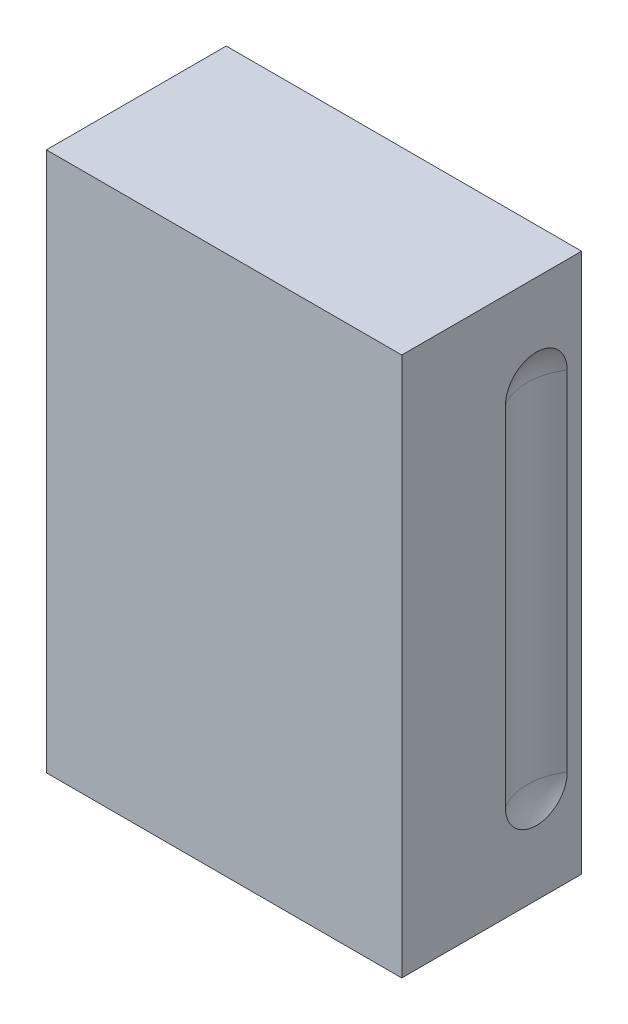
ISO-10303-21;
HEADER;
FILE_DESCRIPTION(('STEP AP214'),'2;1');
FILE_NAME('part.step','',(''),(''),'','','');
FILE_SCHEMA(('AUTOMOTIVE_DESIGN { 1 0 10303 214 1 1 1 1 }'));
ENDSEC;
DATA;
#1=APPLICATION_CONTEXT('core data for automotive mechanical design processes');
#2=APPLICATION_PROTOCOL_DEFINITION('international standard','automotive_design',2000,#1);
#3=PRODUCT_CONTEXT('',#1,'mechanical');
#4=PRODUCT('Part','Part','',(#3));
#5=PRODUCT_RELATED_PRODUCT_CATEGORY('part','',(#4));
#6=PRODUCT_DEFINITION_FORMATION('','',#4);
#7=PRODUCT_DEFINITION_CONTEXT('part definition',#1,'design');
#8=PRODUCT_DEFINITION('design','',#6,#7);
#9=PRODUCT_DEFINITION_SHAPE('','',#8);
#10=(LENGTH_UNIT() NAMED_UNIT(*) SI_UNIT(.MILLI.,.METRE.));
#11=(NAMED_UNIT(*) PLANE_ANGLE_UNIT() SI_UNIT($,.RADIAN.));
#12=(NAMED_UNIT(*) SI_UNIT($,.STERADIAN.) SOLID_ANGLE_UNIT());
#13=UNCERTAINTY_MEASURE_WITH_UNIT(LENGTH_MEASURE(1.E-05),#10,'distance_accuracy_value','');
#14=(GEOMETRIC_REPRESENTATION_CONTEXT(3) GLOBAL_UNCERTAINTY_ASSIGNED_CONTEXT((#13)) GLOBAL_UNIT_ASSIGNED_CONTEXT((#10,
#11,#12)) REPRESENTATION_CONTEXT('',''));
#15=CARTESIAN_POINT('',(0.,0.,0.));
#16=DIRECTION('',(0.,0.,1.));
#17=DIRECTION('',(1.,0.,0.));
#18=AXIS2_PLACEMENT_3D('',#15,#16,#17);
#19=CARTESIAN_POINT('',(15.9999999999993,62.3871827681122,13.));
#20=DIRECTION('',(0.,0.,1.));
#21=DIRECTION('',(1.,0.,0.));
#22=AXIS2_PLACEMENT_3D('',#19,#20,#21);
#23=PLANE('',#22);
#24=DIRECTION('',(1.,0.,0.));
#25=VECTOR('',#24,1.);
#26=CARTESIAN_POINT('',(15.9999999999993,39.3871827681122,13.));
#27=LINE('',#26,#25);
#28=CARTESIAN_POINT('',(5.99999999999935,39.3871827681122,13.));
#29=VERTEX_POINT('',#28);
#30=CARTESIAN_POINT('',(25.9999999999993,39.3871827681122,13.));
#31=VERTEX_POINT('',#30);
#32=EDGE_CURVE('E220',#29,#31,#27,.T.);
#33=ORIENTED_EDGE('',*,*,#32,.F.);
#34=DIRECTION('',(0.,1.,0.));
#35=VECTOR('',#34,1.);
#36=CARTESIAN_POINT('',(5.99999999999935,62.3871827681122,13.));
#37=LINE('',#36,#35);
#38=CARTESIAN_POINT('',(5.99999999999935,85.3871827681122,13.));
#39=VERTEX_POINT('',#38);
#40=EDGE_CURVE('E217',#39,#29,#37,.F.);
#41=ORIENTED_EDGE('',*,*,#40,.F.);
#42=DIRECTION('',(1.,0.,0.));
#43=VECTOR('',#42,1.);
#44=CARTESIAN_POINT('',(15.9999999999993,85.3871827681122,13.));
#45=LINE('',#44,#43);
#46=CARTESIAN_POINT('',(25.9999999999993,85.3871827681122,13.));
#47=VERTEX_POINT('',#46);
#48=EDGE_CURVE('E207',#47,#39,#45,.F.);
#49=ORIENTED_EDGE('',*,*,#48,.F.);
#50=DIRECTION('',(0.,1.,0.));
#51=VECTOR('',#50,1.);
#52=CARTESIAN_POINT('',(25.9999999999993,62.3871827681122,13.));
#53=LINE('',#52,#51);
#54=EDGE_CURVE('E228',#31,#47,#53,.T.);
#55=ORIENTED_EDGE('',*,*,#54,.F.);
#56=EDGE_LOOP('',(#33,#41,#49,#55));
#57=FACE_BOUND('',#56,.T.);
#58=ADVANCED_FACE('F14',(#57),#23,.F.);
#59=CARTESIAN_POINT('',(5.99999999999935,62.3871827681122,8.5));
#60=DIRECTION('',(1.,0.,0.));
#61=DIRECTION('',(0.,0.,-1.));
#62=AXIS2_PLACEMENT_3D('',#59,#60,#61);
#63=PLANE('',#62);
#64=DIRECTION('',(0.,0.,1.));
#65=VECTOR('',#64,1.);
#66=CARTESIAN_POINT('',(5.99999999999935,39.3871827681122,8.5));
#67=LINE('',#66,#65);
#68=CARTESIAN_POINT('',(5.99999999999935,39.3871827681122,4.00000000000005));
#69=VERTEX_POINT('',#68);
#70=EDGE_CURVE('E232',#69,#29,#67,.T.);
#71=ORIENTED_EDGE('',*,*,#70,.F.);
#72=DIRECTION('',(0.,1.,0.));
#73=VECTOR('',#72,1.);
#74=CARTESIAN_POINT('',(5.99999999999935,62.0871827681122,4.00000000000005));
#75=LINE('',#74,#73);
#76=CARTESIAN_POINT('',(5.99999999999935,85.3871827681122,4.00000000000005));
#77=VERTEX_POINT('',#76);
#78=EDGE_CURVE('E227',#69,#77,#75,.T.);
#79=ORIENTED_EDGE('',*,*,#78,.T.);
#80=DIRECTION('',(0.,0.,-1.));
#81=VECTOR('',#80,1.);
#82=CARTESIAN_POINT('',(5.99999999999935,85.3871827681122,8.5));
#83=LINE('',#82,#81);
#84=EDGE_CURVE('E212',#39,#77,#83,.T.);
#85=ORIENTED_EDGE('',*,*,#84,.F.);
#86=ORIENTED_EDGE('',*,*,#40,.T.);
#87=EDGE_LOOP('',(#71,#79,#85,#86));
#88=FACE_BOUND('',#87,.T.);
#89=ADVANCED_FACE('F226',(#88),#63,.T.);
#90=CARTESIAN_POINT('',(15.9999999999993,85.3871827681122,8.5));
#91=DIRECTION('',(0.,-1.,0.));
#92=DIRECTION('',(0.,0.,-1.));
#93=AXIS2_PLACEMENT_3D('',#90,#91,#92);
#94=PLANE('',#93);
#95=ORIENTED_EDGE('',*,*,#84,.T.);
#96=DIRECTION('',(1.,0.,0.));
#97=VECTOR('',#96,1.);
#98=CARTESIAN_POINT('',(15.9999989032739,85.3871827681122,4.00000000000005));
#99=LINE('',#98,#97);
#100=CARTESIAN_POINT('',(25.9999999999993,85.3871827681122,4.00000000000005));
#101=VERTEX_POINT('',#100);
#102=EDGE_CURVE('E276',#77,#101,#99,.T.);
#103=ORIENTED_EDGE('',*,*,#102,.T.);
#104=DIRECTION('',(0.,0.,1.));
#105=VECTOR('',#104,1.);
#106=CARTESIAN_POINT('',(25.9999999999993,85.3871827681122,8.5));
#107=LINE('',#106,#105);
#108=EDGE_CURVE('E214',#47,#101,#107,.F.);
#109=ORIENTED_EDGE('',*,*,#108,.F.);
#110=ORIENTED_EDGE('',*,*,#48,.T.);
#111=EDGE_LOOP('',(#95,#103,#109,#110));
#112=FACE_BOUND('',#111,.T.);
#113=ADVANCED_FACE('F209',(#112),#94,.T.);
#114=CARTESIAN_POINT('',(25.9999999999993,62.3871827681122,8.5));
#115=DIRECTION('',(-1.,0.,0.));
#116=DIRECTION('',(0.,0.,1.));
#117=AXIS2_PLACEMENT_3D('',#114,#115,#116);
#118=PLANE('',#117);
#119=ORIENTED_EDGE('',*,*,#108,.T.);
#120=DIRECTION('',(0.,1.,0.));
#121=VECTOR('',#120,1.);
#122=CARTESIAN_POINT('',(25.9999999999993,62.0871827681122,4.00000000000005));
#123=LINE('',#122,#121);
#124=CARTESIAN_POINT('',(25.9999999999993,39.3871827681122,4.00000000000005));
#125=VERTEX_POINT('',#124);
#126=EDGE_CURVE('E275',#101,#125,#123,.F.);
#127=ORIENTED_EDGE('',*,*,#126,.T.);
#128=DIRECTION('',(0.,0.,1.));
#129=VECTOR('',#128,1.);
#130=CARTESIAN_POINT('',(25.9999999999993,39.3871827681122,8.5));
#131=LINE('',#130,#129);
#132=EDGE_CURVE('E80',#31,#125,#131,.F.);
#133=ORIENTED_EDGE('',*,*,#132,.F.);
#134=ORIENTED_EDGE('',*,*,#54,.T.);
#135=EDGE_LOOP('',(#119,#127,#133,#134));
#136=FACE_BOUND('',#135,.T.);
#137=ADVANCED_FACE('F348',(#136),#118,.T.);
#138=CARTESIAN_POINT('',(15.9999999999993,39.3871827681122,8.5));
#139=DIRECTION('',(0.,1.,0.));
#140=DIRECTION('',(0.,0.,1.));
#141=AXIS2_PLACEMENT_3D('',#138,#139,#140);
#142=PLANE('',#141);
#143=ORIENTED_EDGE('',*,*,#132,.T.);
#144=DIRECTION('',(1.,0.,0.));
#145=VECTOR('',#144,1.);
#146=CARTESIAN_POINT('',(15.9999989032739,39.3871827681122,4.00000000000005));
#147=LINE('',#146,#145);
#148=EDGE_CURVE('E94',#125,#69,#147,.F.);
#149=ORIENTED_EDGE('',*,*,#148,.T.);
#150=ORIENTED_EDGE('',*,*,#70,.T.);
#151=ORIENTED_EDGE('',*,*,#32,.T.);
#152=EDGE_LOOP('',(#143,#149,#150,#151));
#153=FACE_BOUND('',#152,.T.);
#154=ADVANCED_FACE('F246',(#153),#142,.T.);
#155=CARTESIAN_POINT('',(47.3299999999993,37.8828899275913,10.2957071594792));
#156=DIRECTION('',(0.0910676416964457,0.816896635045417,0.569549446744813));
#157=DIRECTION('',(-0.927663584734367,-0.138394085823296,0.346824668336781));
#158=AXIS2_PLACEMENT_3D('',#155,#156,#157);
#159=SPHERICAL_SURFACE('',#158,7.9);
#160=CARTESIAN_POINT('',(47.3299999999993,37.8828899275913,10.2957071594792));
#161=DIRECTION('',(0.,1.,0.));
#162=DIRECTION('',(0.,0.,1.));
#163=AXIS2_PLACEMENT_3D('',#160,#161,#162);
#164=CIRCLE('',#163,7.9);
#165=CARTESIAN_POINT('',(40.6999999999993,37.8828899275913,6.));
#166=VERTEX_POINT('',#165);
#167=CARTESIAN_POINT('',(40.6999999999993,37.8828899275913,14.5914143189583));
#168=VERTEX_POINT('',#167);
#169=EDGE_CURVE('E18',#166,#168,#164,.T.);
#170=ORIENTED_EDGE('',*,*,#169,.T.);
#171=CARTESIAN_POINT('',(40.6999999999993,37.8828899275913,14.5914143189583));
#172=CARTESIAN_POINT('',(40.6999999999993,37.7620718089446,14.5914273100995));
#173=CARTESIAN_POINT('',(40.6999999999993,37.6412555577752,14.5863177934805));
#174=CARTESIAN_POINT('',(40.6999999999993,37.4004874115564,14.5659475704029));
#175=CARTESIAN_POINT('',(40.6999999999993,37.2805354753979,14.550687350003));
#176=CARTESIAN_POINT('',(40.6999999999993,37.0424285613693,14.5101237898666));
#177=CARTESIAN_POINT('',(40.6999999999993,36.9242723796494,14.4848275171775));
#178=CARTESIAN_POINT('',(40.6999999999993,36.6905112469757,14.4243758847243));
#179=CARTESIAN_POINT('',(40.6999999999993,36.5749062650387,14.389220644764));
#180=CARTESIAN_POINT('',(40.6999999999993,36.3470347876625,14.3092881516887));
#181=CARTESIAN_POINT('',(40.6999999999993,36.2347692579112,14.2645081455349));
#182=CARTESIAN_POINT('',(40.6999999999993,36.0143684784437,14.1656323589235));
#183=CARTESIAN_POINT('',(40.6999999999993,35.9062347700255,14.1115331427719));
#184=CARTESIAN_POINT('',(40.6999999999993,35.6949705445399,13.994448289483));
#185=CARTESIAN_POINT('',(40.6999999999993,35.5918372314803,13.9314676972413));
#186=CARTESIAN_POINT('',(40.6999999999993,35.3912040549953,13.7970196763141));
#187=CARTESIAN_POINT('',(40.6999999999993,35.2937062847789,13.7255491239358));
#188=CARTESIAN_POINT('',(40.6999999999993,35.1051115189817,13.5746742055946));
#189=CARTESIAN_POINT('',(40.6999999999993,35.0140123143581,13.4952726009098));
#190=CARTESIAN_POINT('',(40.6999999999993,34.8387924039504,13.3290483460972));
#191=CARTESIAN_POINT('',(40.6999999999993,34.7546742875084,13.2422229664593));
#192=CARTESIAN_POINT('',(40.6999999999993,34.5940697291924,13.0618134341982));
#193=CARTESIAN_POINT('',(40.6999999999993,34.5175816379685,12.9682307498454));
#194=CARTESIAN_POINT('',(40.6999999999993,34.3727332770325,12.774919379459));
#195=CARTESIAN_POINT('',(40.6999999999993,34.3043760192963,12.6751884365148));
#196=CARTESIAN_POINT('',(40.6999999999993,34.1763348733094,12.4703635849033));
#197=CARTESIAN_POINT('',(40.6999999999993,34.1166474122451,12.3652719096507));
#198=CARTESIAN_POINT('',(40.6999999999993,34.0063160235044,12.1503948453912));
#199=CARTESIAN_POINT('',(40.6999999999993,33.9556754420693,12.0406077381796));
#200=CARTESIAN_POINT('',(40.6999999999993,33.8638449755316,11.8172053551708));
#201=CARTESIAN_POINT('',(40.6999999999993,33.8226510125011,11.703591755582));
#202=CARTESIAN_POINT('',(40.6999999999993,33.7499650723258,11.4732562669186));
#203=CARTESIAN_POINT('',(40.6999999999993,33.7184766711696,11.3565332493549));
#204=CARTESIAN_POINT('',(40.6999999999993,33.665455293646,11.1208890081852));
#205=CARTESIAN_POINT('',(40.6999999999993,33.6439189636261,11.0019685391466));
#206=CARTESIAN_POINT('',(40.6999999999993,33.6109333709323,10.7626945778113));
#207=CARTESIAN_POINT('',(40.6999999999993,33.5994876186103,10.6423406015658));
#208=CARTESIAN_POINT('',(40.6999999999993,33.5867783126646,10.4011144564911));
#209=CARTESIAN_POINT('',(40.6999999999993,33.5855132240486,10.2802423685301));
#210=CARTESIAN_POINT('',(40.6999999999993,33.5931701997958,10.0388212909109));
#211=CARTESIAN_POINT('',(40.6999999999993,33.6020922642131,9.91827230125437));
#212=CARTESIAN_POINT('',(40.6999999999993,33.6300624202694,9.6783347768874));
#213=CARTESIAN_POINT('',(40.6999999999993,33.6491121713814,9.55894643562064));
#214=CARTESIAN_POINT('',(40.6999999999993,33.6971948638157,9.32224057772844));
#215=CARTESIAN_POINT('',(40.6999999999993,33.7262243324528,9.20492235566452));
#216=CARTESIAN_POINT('',(40.6999999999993,33.7940736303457,8.97310671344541));
#217=CARTESIAN_POINT('',(40.6999999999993,33.8328969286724,8.85861030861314));
#218=CARTESIAN_POINT('',(40.6999999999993,33.9200365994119,8.63333732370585));
#219=CARTESIAN_POINT('',(40.6999999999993,33.9683494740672,8.52255939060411));
#220=CARTESIAN_POINT('',(40.6999999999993,34.0741549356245,8.30542346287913));
#221=CARTESIAN_POINT('',(40.6999999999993,34.1316511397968,8.19906723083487));
#222=CARTESIAN_POINT('',(40.6999999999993,34.2553777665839,7.99161596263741));
#223=CARTESIAN_POINT('',(40.6999999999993,34.3216049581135,7.89051899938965));
#224=CARTESIAN_POINT('',(40.6999999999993,34.4623618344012,7.69423112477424));
#225=CARTESIAN_POINT('',(40.6999999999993,34.5368941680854,7.5990421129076));
#226=CARTESIAN_POINT('',(40.6999999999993,34.6936850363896,7.41531631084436));
#227=CARTESIAN_POINT('',(40.6999999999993,34.7759407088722,7.32677707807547));
#228=CARTESIAN_POINT('',(40.6999999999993,34.9476371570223,7.1569212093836));
#229=CARTESIAN_POINT('',(40.6999999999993,35.0370796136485,7.07560627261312));
#230=CARTESIAN_POINT('',(40.6999999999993,35.2224626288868,6.92082909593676));
#231=CARTESIAN_POINT('',(40.6999999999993,35.3184007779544,6.8473639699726));
#232=CARTESIAN_POINT('',(40.6999999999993,35.5161911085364,6.70872624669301));
#233=CARTESIAN_POINT('',(40.6999999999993,35.6180473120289,6.64355938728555));
#234=CARTESIAN_POINT('',(40.6999999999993,35.8268505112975,6.522063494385));
#235=CARTESIAN_POINT('',(40.6999999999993,35.9337956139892,6.46573120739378));
#236=CARTESIAN_POINT('',(40.6999999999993,36.1521581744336,6.36222511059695));
#237=CARTESIAN_POINT('',(40.6999999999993,36.2635799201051,6.31506034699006));
#238=CARTESIAN_POINT('',(40.6999999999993,36.4899618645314,6.23031011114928));
#239=CARTESIAN_POINT('',(40.6999999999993,36.6049207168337,6.19272104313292));
#240=CARTESIAN_POINT('',(40.6999999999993,36.8374663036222,6.12740282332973));
#241=CARTESIAN_POINT('',(40.6999999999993,36.9550500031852,6.09966285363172));
#242=CARTESIAN_POINT('',(40.6999999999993,37.1920889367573,6.05419248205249));
#243=CARTESIAN_POINT('',(40.6999999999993,37.3115432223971,6.03645716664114));
#244=CARTESIAN_POINT('',(40.6999999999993,37.5065295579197,6.01585355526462));
#245=CARTESIAN_POINT('',(40.6999999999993,37.5817494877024,6.0099046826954));
#246=CARTESIAN_POINT('',(40.6999999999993,37.7322736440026,6.00198075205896));
#247=CARTESIAN_POINT('',(40.6999999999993,37.8075775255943,5.99999914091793));
#248=CARTESIAN_POINT('',(40.6999999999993,37.8828899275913,6.));
#249=B_SPLINE_CURVE_WITH_KNOTS('',3,(#171,#172,#173,#174,#175,#176,#177,#178,#179,#180,#181,
#182,#183,#184,#185,#186,#187,#188,#189,#190,#191,#192,#193,#194,#195,#196,#197,#198,#199,#200,
#201,#202,#203,#204,#205,#206,#207,#208,#209,#210,#211,#212,#213,#214,#215,#216,#217,#218,#219,
#220,#221,#222,#223,#224,#225,#226,#227,#228,#229,#230,#231,#232,#233,#234,#235,#236,#237,#238,
#239,#240,#241,#242,#243,#244,#245,#246,#247,#248),.UNSPECIFIED.,.F.,.F.,(4,2,2,2,2,2,2,2,2,2,2,
2,2,2,2,2,2,2,2,2,2,2,2,2,2,2,2,2,2,2,2,2,2,2,2,2,2,2,4),(0.,0.362343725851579,
0.724670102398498,1.08674179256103,1.44880908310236,1.81098007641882,2.17328487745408,
2.53538470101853,2.89761816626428,3.25972595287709,3.62196745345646,3.9841304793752,
4.34642724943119,4.70857429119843,5.07085500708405,5.43297903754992,5.79523633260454,
6.15737146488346,6.51963252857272,6.88183897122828,7.24404541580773,7.60631122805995,
7.96845110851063,8.3307194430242,8.69285449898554,9.05513255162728,9.41727691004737,
9.77953710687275,10.1416635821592,10.5038750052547,10.8659527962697,11.228279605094,
11.590472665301,11.9530213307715,12.3154336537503,12.6774466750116,13.039281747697,
13.2655500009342,13.4914441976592),.UNSPECIFIED.);
#250=EDGE_CURVE('E78',#168,#166,#249,.T.);
#251=ORIENTED_EDGE('',*,*,#250,.T.);
#252=EDGE_LOOP('',(#170,#251));
#253=FACE_BOUND('',#252,.T.);
#254=ADVANCED_FACE('F77',(#253),#159,.F.);
#255=CARTESIAN_POINT('',(47.3299999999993,66.091840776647,10.2957071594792));
#256=DIRECTION('',(0.,1.,0.));
#257=DIRECTION('',(0.,0.,1.));
#258=AXIS2_PLACEMENT_3D('',#255,#256,#257);
#259=CYLINDRICAL_SURFACE('',#258,7.9);
#260=CARTESIAN_POINT('',(47.3299999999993,86.2914756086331,10.2957071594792));
#261=DIRECTION('',(0.,1.,0.));
#262=DIRECTION('',(0.,0.,1.));
#263=AXIS2_PLACEMENT_3D('',#260,#261,#262);
#264=CIRCLE('',#263,7.9);
#265=CARTESIAN_POINT('',(40.6999999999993,86.2914756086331,6.00000000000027));
#266=VERTEX_POINT('',#265);
#267=CARTESIAN_POINT('',(40.6999999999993,86.2914756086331,14.5914143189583));
#268=VERTEX_POINT('',#267);
#269=EDGE_CURVE('E79',#266,#268,#264,.T.);
#270=ORIENTED_EDGE('',*,*,#269,.T.);
#271=DIRECTION('',(0.,-1.,0.));
#272=VECTOR('',#271,1.);
#273=CARTESIAN_POINT('',(40.6999999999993,62.0871827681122,14.5914143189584));
#274=LINE('',#273,#272);
#275=EDGE_CURVE('E85',#268,#168,#274,.T.);
#276=ORIENTED_EDGE('',*,*,#275,.T.);
#277=ORIENTED_EDGE('',*,*,#169,.F.);
#278=DIRECTION('',(0.,-1.,0.));
#279=VECTOR('',#278,1.);
#280=CARTESIAN_POINT('',(40.6999999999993,62.0871827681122,6.));
#281=LINE('',#280,#279);
#282=EDGE_CURVE('E87',#166,#266,#281,.F.);
#283=ORIENTED_EDGE('',*,*,#282,.T.);
#284=EDGE_LOOP('',(#270,#276,#277,#283));
#285=FACE_BOUND('',#284,.T.);
#286=ADVANCED_FACE('F89',(#285),#259,.F.);
#287=CARTESIAN_POINT('',(47.33,86.2914756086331,10.2957071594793));
#288=DIRECTION('',(0.0910676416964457,0.816896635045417,0.569549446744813));
#289=DIRECTION('',(-0.927663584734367,-0.138394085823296,0.346824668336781));
#290=AXIS2_PLACEMENT_3D('',#287,#288,#289);
#291=SPHERICAL_SURFACE('',#290,7.9);
#292=ORIENTED_EDGE('',*,*,#269,.F.);
#293=CARTESIAN_POINT('',(40.6999999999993,86.2914756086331,6.00000000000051));
#294=CARTESIAN_POINT('',(40.6999999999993,86.4122937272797,5.99998700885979));
#295=CARTESIAN_POINT('',(40.6999999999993,86.533109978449,6.00509652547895));
#296=CARTESIAN_POINT('',(40.6999999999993,86.7738781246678,6.02546674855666));
#297=CARTESIAN_POINT('',(40.6999999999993,86.8938300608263,6.04072696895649));
#298=CARTESIAN_POINT('',(40.6999999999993,87.1319369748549,6.08129052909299));
#299=CARTESIAN_POINT('',(40.6999999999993,87.2500931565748,6.1065868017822));
#300=CARTESIAN_POINT('',(40.6999999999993,87.4838542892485,6.16703843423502));
#301=CARTESIAN_POINT('',(40.6999999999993,87.5994592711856,6.20219367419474));
#302=CARTESIAN_POINT('',(40.6999999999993,87.8273307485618,6.28212616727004));
#303=CARTESIAN_POINT('',(40.6999999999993,87.9395962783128,6.32690617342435));
#304=CARTESIAN_POINT('',(40.6999999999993,88.1599970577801,6.42578196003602));
#305=CARTESIAN_POINT('',(40.6999999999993,88.2681307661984,6.47988117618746));
#306=CARTESIAN_POINT('',(40.6999999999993,88.4793949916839,6.59696602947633));
#307=CARTESIAN_POINT('',(40.6999999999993,88.5825283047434,6.65994662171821));
#308=CARTESIAN_POINT('',(40.6999999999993,88.7831614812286,6.79439464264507));
#309=CARTESIAN_POINT('',(40.6999999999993,88.8806592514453,6.86586519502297));
#310=CARTESIAN_POINT('',(40.6999999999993,89.0692540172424,7.01674011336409));
#311=CARTESIAN_POINT('',(40.6999999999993,89.1603532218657,7.0961417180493));
#312=CARTESIAN_POINT('',(40.6999999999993,89.335573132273,7.26236597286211));
#313=CARTESIAN_POINT('',(40.6999999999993,89.4196912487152,7.34919135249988));
#314=CARTESIAN_POINT('',(40.6999999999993,89.5802958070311,7.52960088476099));
#315=CARTESIAN_POINT('',(40.6999999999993,89.6567838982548,7.62318356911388));
#316=CARTESIAN_POINT('',(40.6999999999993,89.8016322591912,7.81649493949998));
#317=CARTESIAN_POINT('',(40.6999999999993,89.8699895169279,7.91622588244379));
#318=CARTESIAN_POINT('',(40.6999999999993,89.9980306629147,8.12105073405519));
#319=CARTESIAN_POINT('',(40.6999999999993,90.0577181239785,8.22614240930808));
#320=CARTESIAN_POINT('',(40.6999999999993,90.1680495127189,8.44101947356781));
#321=CARTESIAN_POINT('',(40.6999999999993,90.2186900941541,8.55080658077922));
#322=CARTESIAN_POINT('',(40.6999999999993,90.3105205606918,8.77420896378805));
#323=CARTESIAN_POINT('',(40.6999999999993,90.351714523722,8.88782256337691));
#324=CARTESIAN_POINT('',(40.6999999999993,90.4244004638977,9.11815805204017));
#325=CARTESIAN_POINT('',(40.6999999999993,90.4558888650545,9.23488106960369));
#326=CARTESIAN_POINT('',(40.6999999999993,90.5089102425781,9.47052531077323));
#327=CARTESIAN_POINT('',(40.6999999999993,90.5304465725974,9.58944577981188));
#328=CARTESIAN_POINT('',(40.6999999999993,90.5634321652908,9.82871974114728));
#329=CARTESIAN_POINT('',(40.6999999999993,90.574877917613,9.94907371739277));
#330=CARTESIAN_POINT('',(40.6999999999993,90.5875872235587,10.1902998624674));
#331=CARTESIAN_POINT('',(40.6999999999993,90.5888523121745,10.3111719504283));
#332=CARTESIAN_POINT('',(40.6999999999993,90.5811953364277,10.5525930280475));
#333=CARTESIAN_POINT('',(40.6999999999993,90.572273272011,10.6731420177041));
#334=CARTESIAN_POINT('',(40.6999999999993,90.5443031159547,10.913079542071));
#335=CARTESIAN_POINT('',(40.6999999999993,90.5252533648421,11.0324678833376));
#336=CARTESIAN_POINT('',(40.6999999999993,90.4771706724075,11.2691737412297));
#337=CARTESIAN_POINT('',(40.6999999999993,90.4481412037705,11.3864919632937));
#338=CARTESIAN_POINT('',(40.6999999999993,90.3802919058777,11.6183076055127));
#339=CARTESIAN_POINT('',(40.6999999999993,90.3414686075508,11.7328040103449));
#340=CARTESIAN_POINT('',(40.6999999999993,90.2543289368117,11.9580769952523));
#341=CARTESIAN_POINT('',(40.6999999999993,90.206016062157,12.0688549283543));
#342=CARTESIAN_POINT('',(40.6999999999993,90.1002106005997,12.2859908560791));
#343=CARTESIAN_POINT('',(40.6999999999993,90.0427143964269,12.3923470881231));
#344=CARTESIAN_POINT('',(40.6999999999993,89.9189877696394,12.5997983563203));
#345=CARTESIAN_POINT('',(40.6999999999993,89.85276057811,12.7008953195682));
#346=CARTESIAN_POINT('',(40.6999999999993,89.7120037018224,12.8971831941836));
#347=CARTESIAN_POINT('',(40.6999999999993,89.637471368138,12.9923722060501));
#348=CARTESIAN_POINT('',(40.6999999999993,89.4806804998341,13.1760980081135));
#349=CARTESIAN_POINT('',(40.6999999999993,89.398424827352,13.2646372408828));
#350=CARTESIAN_POINT('',(40.6999999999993,89.226728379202,13.4344931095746));
#351=CARTESIAN_POINT('',(40.6999999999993,89.1372859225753,13.5158080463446));
#352=CARTESIAN_POINT('',(40.6999999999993,88.9519029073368,13.6705852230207));
#353=CARTESIAN_POINT('',(40.6999999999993,88.8559647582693,13.744050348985));
#354=CARTESIAN_POINT('',(40.6999999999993,88.6581744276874,13.8826880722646));
#355=CARTESIAN_POINT('',(40.6999999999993,88.5563182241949,13.9478549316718));
#356=CARTESIAN_POINT('',(40.6999999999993,88.3475150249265,14.0693508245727));
#357=CARTESIAN_POINT('',(40.6999999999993,88.240569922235,14.1256831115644));
#358=CARTESIAN_POINT('',(40.6999999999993,88.0222073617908,14.2291892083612));
#359=CARTESIAN_POINT('',(40.6999999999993,87.910785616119,14.2763539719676));
#360=CARTESIAN_POINT('',(40.6999999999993,87.6844036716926,14.361104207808));
#361=CARTESIAN_POINT('',(40.6999999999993,87.5694448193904,14.3986932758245));
#362=CARTESIAN_POINT('',(40.6999999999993,87.336899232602,14.4640114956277));
#363=CARTESIAN_POINT('',(40.6999999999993,87.219315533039,14.4917514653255));
#364=CARTESIAN_POINT('',(40.6999999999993,86.9822765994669,14.5372218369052));
#365=CARTESIAN_POINT('',(40.6999999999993,86.8628223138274,14.5549571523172));
#366=CARTESIAN_POINT('',(40.6999999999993,86.6678359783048,14.5755607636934));
#367=CARTESIAN_POINT('',(40.6999999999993,86.592616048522,14.5815096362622));
#368=CARTESIAN_POINT('',(40.6999999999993,86.4420918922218,14.5894335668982));
#369=CARTESIAN_POINT('',(40.6999999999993,86.36678801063,14.5914151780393));
#370=CARTESIAN_POINT('',(40.6999999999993,86.2914756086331,14.5914143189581));
#371=B_SPLINE_CURVE_WITH_KNOTS('',3,(#293,#294,#295,#296,#297,#298,#299,#300,#301,#302,#303,
#304,#305,#306,#307,#308,#309,#310,#311,#312,#313,#314,#315,#316,#317,#318,#319,#320,#321,#322,
#323,#324,#325,#326,#327,#328,#329,#330,#331,#332,#333,#334,#335,#336,#337,#338,#339,#340,#341,
#342,#343,#344,#345,#346,#347,#348,#349,#350,#351,#352,#353,#354,#355,#356,#357,#358,#359,#360,
#361,#362,#363,#364,#365,#366,#367,#368,#369,#370),.UNSPECIFIED.,.F.,.F.,(4,2,2,2,2,2,2,2,2,2,2,
2,2,2,2,2,2,2,2,2,2,2,2,2,2,2,2,2,2,2,2,2,2,2,2,2,2,2,4),(0.,0.362343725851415,
0.724670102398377,1.08674179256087,1.44880908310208,1.81098007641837,2.17328487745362,
2.535384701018,2.89761816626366,3.25972595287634,3.62196745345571,3.98413047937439,
4.34642724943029,4.70857429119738,5.07085500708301,5.43297903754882,5.79523633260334,
6.15737146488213,6.51963252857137,6.88183897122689,7.24404541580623,7.60631122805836,
7.96845110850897,8.33071944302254,8.69285449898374,9.05513255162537,9.41727691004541,
9.77953710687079,10.1416635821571,10.5038750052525,10.8659527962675,11.2282796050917,
11.5904726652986,11.953021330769,12.3154336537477,12.677446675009,13.0392817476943,
13.2655500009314,13.4914441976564),.UNSPECIFIED.);
#372=EDGE_CURVE('E106',#266,#268,#371,.T.);
#373=ORIENTED_EDGE('',*,*,#372,.T.);
#374=EDGE_LOOP('',(#292,#373));
#375=FACE_BOUND('',#374,.T.);
#376=ADVANCED_FACE('F288',(#375),#291,.F.);
#377=CARTESIAN_POINT('',(-15.3300000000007,37.8828899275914,10.2957071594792));
#378=DIRECTION('',(0.0910676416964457,0.816896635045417,0.569549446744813));
#379=DIRECTION('',(-0.927663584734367,-0.138394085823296,0.346824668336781));
#380=AXIS2_PLACEMENT_3D('',#377,#378,#379);
#381=SPHERICAL_SURFACE('',#380,7.9);
#382=CARTESIAN_POINT('',(-15.3300000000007,37.8828899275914,10.2957071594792));
#383=DIRECTION('',(0.,-1.,0.));
#384=DIRECTION('',(0.,0.,-1.));
#385=AXIS2_PLACEMENT_3D('',#382,#383,#384);
#386=CIRCLE('',#385,7.9);
#387=CARTESIAN_POINT('',(-8.70000000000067,37.8828899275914,14.5914143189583));
#388=VERTEX_POINT('',#387);
#389=CARTESIAN_POINT('',(-8.70000000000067,37.8828899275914,6.00000000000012));
#390=VERTEX_POINT('',#389);
#391=EDGE_CURVE('E296',#388,#390,#386,.F.);
#392=ORIENTED_EDGE('',*,*,#391,.T.);
#393=CARTESIAN_POINT('',(-8.70000000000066,37.8828899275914,6.));
#394=CARTESIAN_POINT('',(-8.70000000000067,37.7620718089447,5.9999870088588));
#395=CARTESIAN_POINT('',(-8.70000000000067,37.6412555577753,6.00509652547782));
#396=CARTESIAN_POINT('',(-8.70000000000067,37.4004874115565,6.02546674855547));
#397=CARTESIAN_POINT('',(-8.70000000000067,37.280535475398,6.04072696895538));
#398=CARTESIAN_POINT('',(-8.70000000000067,37.0424285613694,6.0812905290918));
#399=CARTESIAN_POINT('',(-8.70000000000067,36.9242723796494,6.10658680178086));
#400=CARTESIAN_POINT('',(-8.70000000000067,36.6905112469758,6.16703843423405));
#401=CARTESIAN_POINT('',(-8.70000000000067,36.5749062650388,6.2021936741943));
#402=CARTESIAN_POINT('',(-8.70000000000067,36.3470347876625,6.28212616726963));
#403=CARTESIAN_POINT('',(-8.70000000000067,36.2347692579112,6.32690617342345));
#404=CARTESIAN_POINT('',(-8.70000000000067,36.0143684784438,6.4257819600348));
#405=CARTESIAN_POINT('',(-8.70000000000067,35.9062347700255,6.47988117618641));
#406=CARTESIAN_POINT('',(-8.70000000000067,35.69497054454,6.59696602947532));
#407=CARTESIAN_POINT('',(-8.70000000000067,35.5918372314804,6.65994662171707));
#408=CARTESIAN_POINT('',(-8.70000000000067,35.3912040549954,6.79439464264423));
#409=CARTESIAN_POINT('',(-8.70000000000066,35.293706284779,6.86586519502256));
#410=CARTESIAN_POINT('',(-8.70000000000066,35.1051115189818,7.01674011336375));
#411=CARTESIAN_POINT('',(-8.70000000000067,35.0140123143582,7.09614171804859));
#412=CARTESIAN_POINT('',(-8.70000000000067,34.8387924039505,7.26236597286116));
#413=CARTESIAN_POINT('',(-8.70000000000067,34.7546742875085,7.34919135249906));
#414=CARTESIAN_POINT('',(-8.70000000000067,34.5940697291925,7.5296008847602));
#415=CARTESIAN_POINT('',(-8.70000000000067,34.5175816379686,7.62318356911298));
#416=CARTESIAN_POINT('',(-8.70000000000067,34.3727332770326,7.81649493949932));
#417=CARTESIAN_POINT('',(-8.70000000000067,34.3043760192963,7.91622588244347));
#418=CARTESIAN_POINT('',(-8.70000000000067,34.1763348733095,8.12105073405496));
#419=CARTESIAN_POINT('',(-8.70000000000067,34.1166474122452,8.2261424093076));
#420=CARTESIAN_POINT('',(-8.70000000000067,34.0063160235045,8.44101947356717));
#421=CARTESIAN_POINT('',(-8.70000000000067,33.9556754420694,8.55080658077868));
#422=CARTESIAN_POINT('',(-8.70000000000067,33.8638449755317,8.77420896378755));
#423=CARTESIAN_POINT('',(-8.70000000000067,33.8226510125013,8.88782256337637));
#424=CARTESIAN_POINT('',(-8.70000000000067,33.7499650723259,9.11815805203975));
#425=CARTESIAN_POINT('',(-8.70000000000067,33.7184766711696,9.23488106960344));
#426=CARTESIAN_POINT('',(-8.70000000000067,33.6654552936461,9.47052531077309));
#427=CARTESIAN_POINT('',(-8.70000000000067,33.6439189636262,9.58944577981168));
#428=CARTESIAN_POINT('',(-8.70000000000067,33.6109333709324,9.82871974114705));
#429=CARTESIAN_POINT('',(-8.70000000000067,33.5994876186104,9.94907371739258));
#430=CARTESIAN_POINT('',(-8.70000000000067,33.5867783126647,10.1902998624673));
#431=CARTESIAN_POINT('',(-8.70000000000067,33.5855132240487,10.3111719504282));
#432=CARTESIAN_POINT('',(-8.70000000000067,33.5931701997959,10.5525930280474));
#433=CARTESIAN_POINT('',(-8.70000000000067,33.6020922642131,10.673142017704));
#434=CARTESIAN_POINT('',(-8.70000000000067,33.6300624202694,10.9130795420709));
#435=CARTESIAN_POINT('',(-8.70000000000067,33.6491121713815,11.0324678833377));
#436=CARTESIAN_POINT('',(-8.70000000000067,33.6971948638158,11.2691737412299));
#437=CARTESIAN_POINT('',(-8.70000000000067,33.7262243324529,11.3864919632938));
#438=CARTESIAN_POINT('',(-8.70000000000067,33.7940736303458,11.6183076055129));
#439=CARTESIAN_POINT('',(-8.70000000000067,33.8328969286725,11.7328040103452));
#440=CARTESIAN_POINT('',(-8.70000000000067,33.9200365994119,11.9580769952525));
#441=CARTESIAN_POINT('',(-8.70000000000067,33.9683494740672,12.0688549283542));
#442=CARTESIAN_POINT('',(-8.70000000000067,34.0741549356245,12.2859908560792));
#443=CARTESIAN_POINT('',(-8.70000000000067,34.1316511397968,12.3923470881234));
#444=CARTESIAN_POINT('',(-8.70000000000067,34.255377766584,12.5997983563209));
#445=CARTESIAN_POINT('',(-8.70000000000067,34.3216049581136,12.7008953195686));
#446=CARTESIAN_POINT('',(-8.70000000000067,34.4623618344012,12.8971831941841));
#447=CARTESIAN_POINT('',(-8.70000000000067,34.5368941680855,12.9923722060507));
#448=CARTESIAN_POINT('',(-8.70000000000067,34.6936850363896,13.1760980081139));
#449=CARTESIAN_POINT('',(-8.70000000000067,34.7759407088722,13.2646372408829));
#450=CARTESIAN_POINT('',(-8.70000000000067,34.9476371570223,13.4344931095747));
#451=CARTESIAN_POINT('',(-8.70000000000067,35.0370796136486,13.5158080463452));
#452=CARTESIAN_POINT('',(-8.70000000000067,35.2224626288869,13.6705852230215));
#453=CARTESIAN_POINT('',(-8.70000000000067,35.3184007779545,13.7440503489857));
#454=CARTESIAN_POINT('',(-8.70000000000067,35.5161911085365,13.8826880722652));
#455=CARTESIAN_POINT('',(-8.70000000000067,35.6180473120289,13.9478549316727));
#456=CARTESIAN_POINT('',(-8.70000000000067,35.8268505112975,14.0693508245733));
#457=CARTESIAN_POINT('',(-8.70000000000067,35.9337956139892,14.1256831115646));
#458=CARTESIAN_POINT('',(-8.70000000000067,36.1521581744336,14.2291892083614));
#459=CARTESIAN_POINT('',(-8.70000000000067,36.2635799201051,14.2763539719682));
#460=CARTESIAN_POINT('',(-8.70000000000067,36.4899618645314,14.361104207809));
#461=CARTESIAN_POINT('',(-8.70000000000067,36.6049207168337,14.3986932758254));
#462=CARTESIAN_POINT('',(-8.70000000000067,36.8374663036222,14.4640114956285));
#463=CARTESIAN_POINT('',(-8.70000000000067,36.9550500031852,14.4917514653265));
#464=CARTESIAN_POINT('',(-8.70000000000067,37.1920889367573,14.5372218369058));
#465=CARTESIAN_POINT('',(-8.70000000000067,37.3115432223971,14.5549571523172));
#466=CARTESIAN_POINT('',(-8.70000000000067,37.5065295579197,14.5755607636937));
#467=CARTESIAN_POINT('',(-8.70000000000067,37.5817494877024,14.5815096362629));
#468=CARTESIAN_POINT('',(-8.70000000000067,37.7322736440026,14.5894335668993));
#469=CARTESIAN_POINT('',(-8.70000000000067,37.8075775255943,14.5914151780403));
#470=CARTESIAN_POINT('',(-8.70000000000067,37.8828899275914,14.5914143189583));
#471=B_SPLINE_CURVE_WITH_KNOTS('',3,(#393,#394,#395,#396,#397,#398,#399,#400,#401,#402,#403,
#404,#405,#406,#407,#408,#409,#410,#411,#412,#413,#414,#415,#416,#417,#418,#419,#420,#421,#422,
#423,#424,#425,#426,#427,#428,#429,#430,#431,#432,#433,#434,#435,#436,#437,#438,#439,#440,#441,
#442,#443,#444,#445,#446,#447,#448,#449,#450,#451,#452,#453,#454,#455,#456,#457,#458,#459,#460,
#461,#462,#463,#464,#465,#466,#467,#468,#469,#470),.UNSPECIFIED.,.F.,.F.,(4,2,2,2,2,2,2,2,2,2,2,
2,2,2,2,2,2,2,2,2,2,2,2,2,2,2,2,2,2,2,2,2,2,2,2,2,2,2,4),(0.,0.362343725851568,
0.724670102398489,1.08674179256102,1.44880908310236,1.81098007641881,2.17328487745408,
2.53538470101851,2.89761816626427,3.25972595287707,3.62196745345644,3.98413047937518,
4.34642724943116,4.70857429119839,5.07085500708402,5.43297903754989,5.7952363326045,
6.15737146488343,6.51963252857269,6.88183897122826,7.2440454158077,7.60631122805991,
7.96845110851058,8.33071944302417,8.69285449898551,9.05513255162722,9.41727691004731,
9.77953710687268,10.1416635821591,10.5038750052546,10.8659527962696,11.2282796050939,
11.5904726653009,11.9530213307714,12.3154336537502,12.6774466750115,13.0392817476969,
13.2655500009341,13.4914441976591),.UNSPECIFIED.);
#472=EDGE_CURVE('E111',#390,#388,#471,.T.);
#473=ORIENTED_EDGE('',*,*,#472,.T.);
#474=EDGE_LOOP('',(#392,#473));
#475=FACE_BOUND('',#474,.T.);
#476=ADVANCED_FACE('F285',(#475),#381,.F.);
#477=CARTESIAN_POINT('',(-15.3300000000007,66.091840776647,10.2957071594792));
#478=DIRECTION('',(0.,-1.,0.));
#479=DIRECTION('',(0.,0.,-1.));
#480=AXIS2_PLACEMENT_3D('',#477,#478,#479);
#481=CYLINDRICAL_SURFACE('',#480,7.9);
#482=ORIENTED_EDGE('',*,*,#391,.F.);
#483=DIRECTION('',(0.,1.,0.));
#484=VECTOR('',#483,1.);
#485=CARTESIAN_POINT('',(-8.70000000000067,62.0871827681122,14.5914143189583));
#486=LINE('',#485,#484);
#487=CARTESIAN_POINT('',(-8.70000000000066,86.2914756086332,14.5914143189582));
#488=VERTEX_POINT('',#487);
#489=EDGE_CURVE('E107',#388,#488,#486,.T.);
#490=ORIENTED_EDGE('',*,*,#489,.T.);
#491=CARTESIAN_POINT('',(-15.3300000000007,86.2914756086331,10.2957071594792));
#492=DIRECTION('',(0.,-1.,0.));
#493=DIRECTION('',(0.,0.,-1.));
#494=AXIS2_PLACEMENT_3D('',#491,#492,#493);
#495=CIRCLE('',#494,7.9);
#496=CARTESIAN_POINT('',(-8.70000000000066,86.2914756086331,6.00000000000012));
#497=VERTEX_POINT('',#496);
#498=EDGE_CURVE('E258',#488,#497,#495,.F.);
#499=ORIENTED_EDGE('',*,*,#498,.T.);
#500=DIRECTION('',(0.,1.,0.));
#501=VECTOR('',#500,1.);
#502=CARTESIAN_POINT('',(-8.70000000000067,62.0871827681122,6.00000000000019));
#503=LINE('',#502,#501);
#504=EDGE_CURVE('E112',#497,#390,#503,.F.);
#505=ORIENTED_EDGE('',*,*,#504,.T.);
#506=EDGE_LOOP('',(#482,#490,#499,#505));
#507=FACE_BOUND('',#506,.T.);
#508=ADVANCED_FACE('F269',(#507),#481,.F.);
#509=CARTESIAN_POINT('',(-15.3300000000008,86.2914756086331,10.2957071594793));
#510=DIRECTION('',(0.0910676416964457,0.816896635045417,0.569549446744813));
#511=DIRECTION('',(-0.927663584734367,-0.138394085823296,0.346824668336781));
#512=AXIS2_PLACEMENT_3D('',#509,#510,#511);
#513=SPHERICAL_SURFACE('',#512,7.9);
#514=ORIENTED_EDGE('',*,*,#498,.F.);
#515=CARTESIAN_POINT('',(-8.70000000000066,86.2914756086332,14.5914143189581));
#516=CARTESIAN_POINT('',(-8.70000000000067,86.4122937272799,14.5914273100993));
#517=CARTESIAN_POINT('',(-8.70000000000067,86.5331099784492,14.5863177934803));
#518=CARTESIAN_POINT('',(-8.70000000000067,86.773878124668,14.5659475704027));
#519=CARTESIAN_POINT('',(-8.70000000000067,86.8938300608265,14.5506873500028));
#520=CARTESIAN_POINT('',(-8.70000000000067,87.1319369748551,14.5101237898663));
#521=CARTESIAN_POINT('',(-8.70000000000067,87.250093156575,14.4848275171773));
#522=CARTESIAN_POINT('',(-8.70000000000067,87.4838542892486,14.4243758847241));
#523=CARTESIAN_POINT('',(-8.70000000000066,87.5994592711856,14.3892206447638));
#524=CARTESIAN_POINT('',(-8.70000000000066,87.8273307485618,14.3092881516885));
#525=CARTESIAN_POINT('',(-8.70000000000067,87.9395962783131,14.2645081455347));
#526=CARTESIAN_POINT('',(-8.70000000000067,88.1599970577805,14.1656323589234));
#527=CARTESIAN_POINT('',(-8.70000000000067,88.2681307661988,14.1115331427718));
#528=CARTESIAN_POINT('',(-8.70000000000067,88.4793949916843,13.9944482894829));
#529=CARTESIAN_POINT('',(-8.70000000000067,88.5825283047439,13.9314676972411));
#530=CARTESIAN_POINT('',(-8.70000000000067,88.7831614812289,13.797019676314));
#531=CARTESIAN_POINT('',(-8.70000000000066,88.8806592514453,13.7255491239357));
#532=CARTESIAN_POINT('',(-8.70000000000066,89.0692540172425,13.5746742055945));
#533=CARTESIAN_POINT('',(-8.70000000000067,89.1603532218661,13.4952726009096));
#534=CARTESIAN_POINT('',(-8.70000000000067,89.3355731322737,13.329048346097));
#535=CARTESIAN_POINT('',(-8.70000000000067,89.4196912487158,13.2422229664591));
#536=CARTESIAN_POINT('',(-8.70000000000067,89.5802958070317,13.061813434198));
#537=CARTESIAN_POINT('',(-8.70000000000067,89.6567838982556,12.9682307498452));
#538=CARTESIAN_POINT('',(-8.70000000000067,89.8016322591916,12.7749193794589));
#539=CARTESIAN_POINT('',(-8.70000000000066,89.869989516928,12.6751884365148));
#540=CARTESIAN_POINT('',(-8.70000000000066,89.9980306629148,12.4703635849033));
#541=CARTESIAN_POINT('',(-8.70000000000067,90.0577181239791,12.3652719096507));
#542=CARTESIAN_POINT('',(-8.70000000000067,90.1680495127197,12.1503948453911));
#543=CARTESIAN_POINT('',(-8.70000000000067,90.2186900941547,12.0406077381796));
#544=CARTESIAN_POINT('',(-8.70000000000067,90.3105205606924,11.8172053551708));
#545=CARTESIAN_POINT('',(-8.70000000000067,90.3517145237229,11.703591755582));
#546=CARTESIAN_POINT('',(-8.70000000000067,90.4244004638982,11.4732562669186));
#547=CARTESIAN_POINT('',(-8.70000000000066,90.4558888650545,11.3565332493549));
#548=CARTESIAN_POINT('',(-8.70000000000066,90.5089102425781,11.1208890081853));
#549=CARTESIAN_POINT('',(-8.70000000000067,90.5304465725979,11.0019685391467));
#550=CARTESIAN_POINT('',(-8.70000000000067,90.5634321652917,10.7626945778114));
#551=CARTESIAN_POINT('',(-8.70000000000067,90.5748779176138,10.6423406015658));
#552=CARTESIAN_POINT('',(-8.70000000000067,90.5875872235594,10.4011144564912));
#553=CARTESIAN_POINT('',(-8.70000000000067,90.5888523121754,10.2802423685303));
#554=CARTESIAN_POINT('',(-8.70000000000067,90.5811953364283,10.0388212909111));
#555=CARTESIAN_POINT('',(-8.70000000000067,90.5722732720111,9.91827230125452));
#556=CARTESIAN_POINT('',(-8.70000000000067,90.5443031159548,9.67833477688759));
#557=CARTESIAN_POINT('',(-8.70000000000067,90.5252533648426,9.55894643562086));
#558=CARTESIAN_POINT('',(-8.70000000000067,90.4771706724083,9.32224057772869));
#559=CARTESIAN_POINT('',(-8.70000000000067,90.4481412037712,9.20492235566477));
#560=CARTESIAN_POINT('',(-8.70000000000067,90.3802919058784,8.97310671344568));
#561=CARTESIAN_POINT('',(-8.70000000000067,90.3414686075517,8.85861030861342));
#562=CARTESIAN_POINT('',(-8.70000000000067,90.2543289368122,8.63333732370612));
#563=CARTESIAN_POINT('',(-8.70000000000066,90.206016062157,8.52255939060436));
#564=CARTESIAN_POINT('',(-8.70000000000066,90.1002106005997,8.30542346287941));
#565=CARTESIAN_POINT('',(-8.70000000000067,90.0427143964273,8.19906723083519));
#566=CARTESIAN_POINT('',(-8.70000000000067,89.9189877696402,7.99161596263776));
#567=CARTESIAN_POINT('',(-8.70000000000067,89.8527605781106,7.89051899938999));
#568=CARTESIAN_POINT('',(-8.70000000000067,89.712003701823,7.69423112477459));
#569=CARTESIAN_POINT('',(-8.70000000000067,89.6374713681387,7.59904211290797));
#570=CARTESIAN_POINT('',(-8.70000000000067,89.4806804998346,7.41531631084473));
#571=CARTESIAN_POINT('',(-8.70000000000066,89.398424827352,7.32677707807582));
#572=CARTESIAN_POINT('',(-8.70000000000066,89.2267283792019,7.15692120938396));
#573=CARTESIAN_POINT('',(-8.70000000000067,89.1372859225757,7.07560627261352));
#574=CARTESIAN_POINT('',(-8.70000000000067,88.9519029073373,6.92082909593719));
#575=CARTESIAN_POINT('',(-8.70000000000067,88.8559647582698,6.84736396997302));
#576=CARTESIAN_POINT('',(-8.70000000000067,88.6581744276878,6.70872624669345));
#577=CARTESIAN_POINT('',(-8.70000000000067,88.5563182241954,6.64355938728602));
#578=CARTESIAN_POINT('',(-8.70000000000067,88.3475150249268,6.52206349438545));
#579=CARTESIAN_POINT('',(-8.70000000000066,88.2405699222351,6.46573120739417));
#580=CARTESIAN_POINT('',(-8.70000000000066,88.0222073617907,6.36222511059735));
#581=CARTESIAN_POINT('',(-8.70000000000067,87.9107856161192,6.31506034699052));
#582=CARTESIAN_POINT('',(-8.70000000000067,87.6844036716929,6.23031011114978));
#583=CARTESIAN_POINT('',(-8.70000000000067,87.5694448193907,6.19272104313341));
#584=CARTESIAN_POINT('',(-8.70000000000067,87.3368992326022,6.12740282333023));
#585=CARTESIAN_POINT('',(-8.70000000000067,87.2193155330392,6.09966285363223));
#586=CARTESIAN_POINT('',(-8.70000000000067,86.9822765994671,6.05419248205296));
#587=CARTESIAN_POINT('',(-8.70000000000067,86.8628223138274,6.03645716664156));
#588=CARTESIAN_POINT('',(-8.70000000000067,86.6678359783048,6.01585355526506));
#589=CARTESIAN_POINT('',(-8.70000000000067,86.592616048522,6.00990468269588));
#590=CARTESIAN_POINT('',(-8.70000000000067,86.4420918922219,6.00198075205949));
#591=CARTESIAN_POINT('',(-8.70000000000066,86.3667880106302,5.99999914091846));
#592=CARTESIAN_POINT('',(-8.70000000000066,86.2914756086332,6.00000000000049));
#593=B_SPLINE_CURVE_WITH_KNOTS('',3,(#515,#516,#517,#518,#519,#520,#521,#522,#523,#524,#525,
#526,#527,#528,#529,#530,#531,#532,#533,#534,#535,#536,#537,#538,#539,#540,#541,#542,#543,#544,
#545,#546,#547,#548,#549,#550,#551,#552,#553,#554,#555,#556,#557,#558,#559,#560,#561,#562,#563,
#564,#565,#566,#567,#568,#569,#570,#571,#572,#573,#574,#575,#576,#577,#578,#579,#580,#581,#582,
#583,#584,#585,#586,#587,#588,#589,#590,#591,#592),.UNSPECIFIED.,.F.,.F.,(4,2,2,2,2,2,2,2,2,2,2,
2,2,2,2,2,2,2,2,2,2,2,2,2,2,2,2,2,2,2,2,2,2,2,2,2,2,2,4),(0.,0.362343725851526,
0.724670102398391,1.08674179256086,1.44880908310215,1.81098007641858,2.17328487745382,
2.53538470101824,2.89761816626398,3.25972595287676,3.62196745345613,3.98413047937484,
4.3464272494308,4.70857429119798,5.07085500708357,5.43297903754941,5.79523633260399,
6.15737146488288,6.51963252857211,6.88183897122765,7.24404541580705,7.60631122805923,
7.96845110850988,8.33071944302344,8.69285449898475,9.05513255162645,9.41727691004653,
9.77953710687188,10.1416635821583,10.5038750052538,10.8659527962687,11.228279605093,
11.5904726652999,11.9530213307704,12.3154336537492,12.6774466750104,13.0392817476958,
13.2655500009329,13.4914441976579),.UNSPECIFIED.);
#594=EDGE_CURVE('E110',#488,#497,#593,.T.);
#595=ORIENTED_EDGE('',*,*,#594,.T.);
#596=EDGE_LOOP('',(#514,#595));
#597=FACE_BOUND('',#596,.T.);
#598=ADVANCED_FACE('F149',(#597),#513,.F.);
#599=CARTESIAN_POINT('',(15.9999989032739,62.0871827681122,4.00000000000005));
#600=DIRECTION('',(0.,0.,1.));
#601=DIRECTION('',(1.,0.,0.));
#602=AXIS2_PLACEMENT_3D('',#599,#600,#601);
#603=PLANE('',#602);
#604=DIRECTION('',(0.,1.,0.));
#605=VECTOR('',#604,1.);
#606=CARTESIAN_POINT('',(-8.70000000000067,62.0871827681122,4.00000000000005));
#607=LINE('',#606,#605);
#608=CARTESIAN_POINT('',(-8.70000000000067,24.5871827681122,4.00000000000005));
#609=VERTEX_POINT('',#608);
#610=CARTESIAN_POINT('',(-8.6999997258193,99.5871827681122,4.00000000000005));
#611=VERTEX_POINT('',#610);
#612=EDGE_CURVE('E115',#609,#611,#607,.T.);
#613=ORIENTED_EDGE('',*,*,#612,.T.);
#614=DIRECTION('',(1.,0.,0.));
#615=VECTOR('',#614,1.);
#616=CARTESIAN_POINT('',(15.9999989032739,99.5871827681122,4.00000000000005));
#617=LINE('',#616,#615);
#618=CARTESIAN_POINT('',(40.6999999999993,99.5871829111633,4.00000000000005));
#619=VERTEX_POINT('',#618);
#620=EDGE_CURVE('E124',#611,#619,#617,.T.);
#621=ORIENTED_EDGE('',*,*,#620,.T.);
#622=DIRECTION('',(0.,-1.,0.));
#623=VECTOR('',#622,1.);
#624=CARTESIAN_POINT('',(40.6999999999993,62.0871827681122,4.00000000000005));
#625=LINE('',#624,#623);
#626=CARTESIAN_POINT('',(40.7000002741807,24.5871827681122,4.00000000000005));
#627=VERTEX_POINT('',#626);
#628=EDGE_CURVE('E91',#619,#627,#625,.T.);
#629=ORIENTED_EDGE('',*,*,#628,.T.);
#630=DIRECTION('',(1.,0.,0.));
#631=VECTOR('',#630,1.);
#632=CARTESIAN_POINT('',(15.9999989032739,24.5871827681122,4.00000000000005));
#633=LINE('',#632,#631);
#634=EDGE_CURVE('E99',#627,#609,#633,.F.);
#635=ORIENTED_EDGE('',*,*,#634,.T.);
#636=EDGE_LOOP('',(#613,#621,#629,#635));
#637=FACE_BOUND('',#636,.T.);
#638=ORIENTED_EDGE('',*,*,#126,.F.);
#639=ORIENTED_EDGE('',*,*,#102,.F.);
#640=ORIENTED_EDGE('',*,*,#78,.F.);
#641=ORIENTED_EDGE('',*,*,#148,.F.);
#642=EDGE_LOOP('',(#638,#639,#640,#641));
#643=FACE_BOUND('',#642,.T.);
#644=ADVANCED_FACE('F262',(#637,#643),#603,.F.);
#645=CARTESIAN_POINT('',(40.6999999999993,62.0871827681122,21.5));
#646=DIRECTION('',(-1.,0.,0.));
#647=DIRECTION('',(0.,-1.,0.));
#648=AXIS2_PLACEMENT_3D('',#645,#646,#647);
#649=PLANE('',#648);
#650=ORIENTED_EDGE('',*,*,#282,.F.);
#651=ORIENTED_EDGE('',*,*,#250,.F.);
#652=ORIENTED_EDGE('',*,*,#275,.F.);
#653=ORIENTED_EDGE('',*,*,#372,.F.);
#654=EDGE_LOOP('',(#650,#651,#652,#653));
#655=FACE_BOUND('',#654,.T.);
#656=ORIENTED_EDGE('',*,*,#628,.F.);
#657=DIRECTION('',(0.,0.,1.));
#658=VECTOR('',#657,1.);
#659=CARTESIAN_POINT('',(40.6999999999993,99.5871827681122,21.5));
#660=LINE('',#659,#658);
#661=CARTESIAN_POINT('',(40.7000002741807,99.5871831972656,29.0000001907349));
#662=VERTEX_POINT('',#661);
#663=EDGE_CURVE('E120',#619,#662,#660,.T.);
#664=ORIENTED_EDGE('',*,*,#663,.T.);
#665=DIRECTION('',(0.,1.,0.));
#666=VECTOR('',#665,1.);
#667=CARTESIAN_POINT('',(40.7000010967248,99.5871833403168,29.0000001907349));
#668=LINE('',#667,#666);
#669=CARTESIAN_POINT('',(40.7000005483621,24.5871827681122,29.0000001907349));
#670=VERTEX_POINT('',#669);
#671=EDGE_CURVE('E123',#662,#670,#668,.F.);
#672=ORIENTED_EDGE('',*,*,#671,.T.);
#673=DIRECTION('',(0.,0.,1.));
#674=VECTOR('',#673,1.);
#675=CARTESIAN_POINT('',(40.7000010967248,24.5871827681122,21.5));
#676=LINE('',#675,#674);
#677=EDGE_CURVE('E103',#670,#627,#676,.F.);
#678=ORIENTED_EDGE('',*,*,#677,.T.);
#679=EDGE_LOOP('',(#656,#664,#672,#678));
#680=FACE_BOUND('',#679,.T.);
#681=ADVANCED_FACE('F82',(#655,#680),#649,.F.);
#682=CARTESIAN_POINT('',(15.9999989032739,24.5871827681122,21.5));
#683=DIRECTION('',(0.,1.,0.));
#684=DIRECTION('',(0.,0.,1.));
#685=AXIS2_PLACEMENT_3D('',#682,#683,#684);
#686=PLANE('',#685);
#687=ORIENTED_EDGE('',*,*,#634,.F.);
#688=ORIENTED_EDGE('',*,*,#677,.F.);
#689=DIRECTION('',(-1.,0.,0.));
#690=VECTOR('',#689,1.);
#691=CARTESIAN_POINT('',(-23.2500000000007,24.5871827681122,29.0000001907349));
#692=LINE('',#691,#690);
#693=CARTESIAN_POINT('',(-8.6999997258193,24.5871827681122,29.0000001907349));
#694=VERTEX_POINT('',#693);
#695=EDGE_CURVE('E130',#670,#694,#692,.T.);
#696=ORIENTED_EDGE('',*,*,#695,.T.);
#697=DIRECTION('',(0.,0.,1.));
#698=VECTOR('',#697,1.);
#699=CARTESIAN_POINT('',(-8.70000000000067,24.5871827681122,21.5));
#700=LINE('',#699,#698);
#701=EDGE_CURVE('E102',#694,#609,#700,.F.);
#702=ORIENTED_EDGE('',*,*,#701,.T.);
#703=EDGE_LOOP('',(#687,#688,#696,#702));
#704=FACE_BOUND('',#703,.T.);
#705=ADVANCED_FACE('F159',(#704),#686,.F.);
#706=CARTESIAN_POINT('',(-8.70000000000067,62.0871827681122,21.5));
#707=DIRECTION('',(1.,0.,0.));
#708=DIRECTION('',(0.,1.,0.));
#709=AXIS2_PLACEMENT_3D('',#706,#707,#708);
#710=PLANE('',#709);
#711=ORIENTED_EDGE('',*,*,#489,.F.);
#712=ORIENTED_EDGE('',*,*,#472,.F.);
#713=ORIENTED_EDGE('',*,*,#504,.F.);
#714=ORIENTED_EDGE('',*,*,#594,.F.);
#715=EDGE_LOOP('',(#711,#712,#713,#714));
#716=FACE_BOUND('',#715,.T.);
#717=ORIENTED_EDGE('',*,*,#612,.F.);
#718=ORIENTED_EDGE('',*,*,#701,.F.);
#719=DIRECTION('',(0.,1.,0.));
#720=VECTOR('',#719,1.);
#721=CARTESIAN_POINT('',(-8.69999890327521,99.5871833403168,29.0000001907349));
#722=LINE('',#721,#720);
#723=CARTESIAN_POINT('',(-8.69999945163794,99.5871829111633,29.0000001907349));
#724=VERTEX_POINT('',#723);
#725=EDGE_CURVE('E24',#694,#724,#722,.T.);
#726=ORIENTED_EDGE('',*,*,#725,.T.);
#727=DIRECTION('',(0.,0.,1.));
#728=VECTOR('',#727,1.);
#729=CARTESIAN_POINT('',(-8.69999890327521,99.5871827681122,21.5));
#730=LINE('',#729,#728);
#731=EDGE_CURVE('E32',#724,#611,#730,.F.);
#732=ORIENTED_EDGE('',*,*,#731,.T.);
#733=EDGE_LOOP('',(#717,#718,#726,#732));
#734=FACE_BOUND('',#733,.T.);
#735=ADVANCED_FACE('F154',(#716,#734),#710,.F.);
#736=CARTESIAN_POINT('',(15.9999989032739,99.5871827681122,21.5));
#737=DIRECTION('',(0.,-1.,0.));
#738=DIRECTION('',(1.,0.,0.));
#739=AXIS2_PLACEMENT_3D('',#736,#737,#738);
#740=PLANE('',#739);
#741=ORIENTED_EDGE('',*,*,#620,.F.);
#742=ORIENTED_EDGE('',*,*,#731,.F.);
#743=DIRECTION('',(-1.,0.,0.));
#744=VECTOR('',#743,1.);
#745=CARTESIAN_POINT('',(-23.2500000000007,99.5871833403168,29.0000001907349));
#746=LINE('',#745,#744);
#747=EDGE_CURVE('E9',#724,#662,#746,.F.);
#748=ORIENTED_EDGE('',*,*,#747,.T.);
#749=ORIENTED_EDGE('',*,*,#663,.F.);
#750=EDGE_LOOP('',(#741,#742,#748,#749));
#751=FACE_BOUND('',#750,.T.);
#752=ADVANCED_FACE('F158',(#751),#740,.F.);
#753=CARTESIAN_POINT('',(-23.2500000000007,99.5871833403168,29.0000001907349));
#754=DIRECTION('',(0.,0.,-1.));
#755=DIRECTION('',(-1.,0.,0.));
#756=AXIS2_PLACEMENT_3D('',#753,#754,#755);
#757=PLANE('',#756);
#758=ORIENTED_EDGE('',*,*,#725,.F.);
#759=ORIENTED_EDGE('',*,*,#695,.F.);
#760=ORIENTED_EDGE('',*,*,#671,.F.);
#761=ORIENTED_EDGE('',*,*,#747,.F.);
#762=EDGE_LOOP('',(#758,#759,#760,#761));
#763=FACE_BOUND('',#762,.T.);
#764=ADVANCED_FACE('F16',(#763),#757,.F.);
#765=CLOSED_SHELL('',(#58,#89,#113,#137,#154,#254,#286,#376,#476,#508,#598,#644,#681,#705,#735,
#752,#764));
#766=MANIFOLD_SOLID_BREP('B1',#765);
#767=ADVANCED_BREP_SHAPE_REPRESENTATION('',(#18,#766),#14);
#768=SHAPE_DEFINITION_REPRESENTATION(#9,#767);
ENDSEC;
END-ISO-10303-21;
